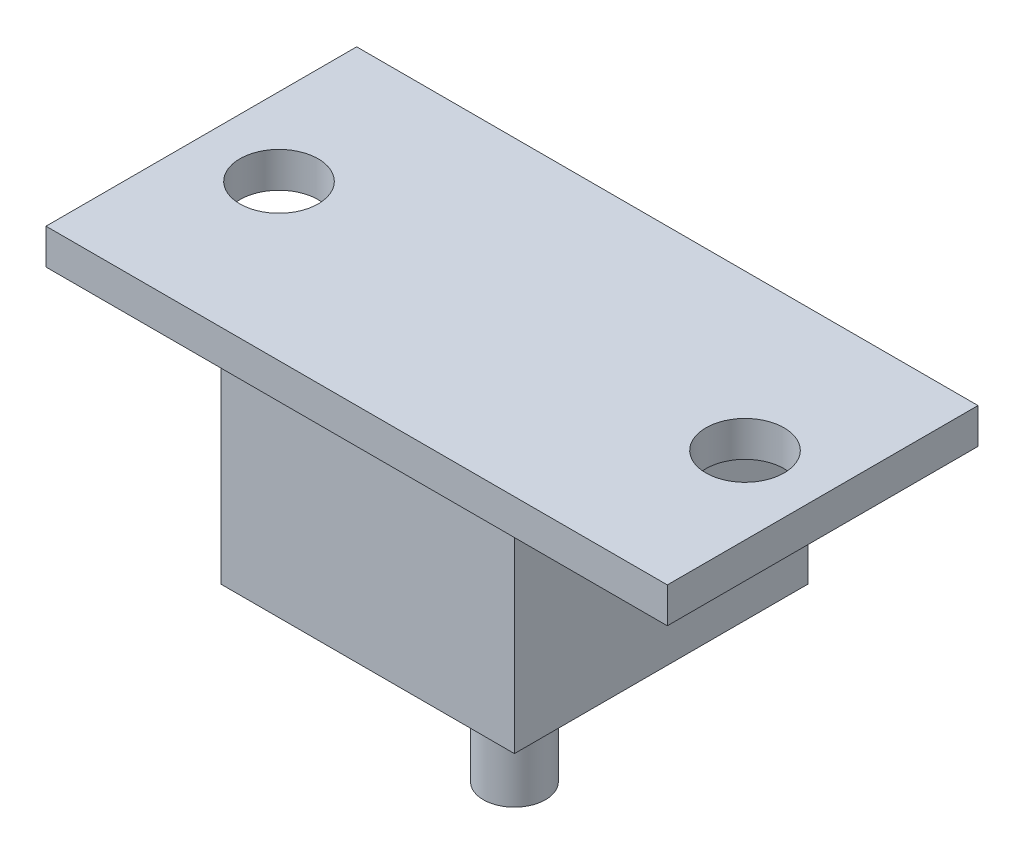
from build123d import *

# Parameters (mm, degrees)
SKETCH1_W            = 25.4
SKETCH1_H            = 12.7
BOSS_EXTRUDE1_DEPTH  = 1.4478
M3_CLEARANCE_HOLE3_D = 3.2
SKETCH5_W            = 12
SKETCH5_H            = 12
BOSS_EXTRUDE2_DEPTH  = 8
SKETCH6_R            = 1.27
BOSS_EXTRUDE3_DEPTH  = 7


with BuildPart() as part:
    # Sketch1 → Boss-Extrude1 (new body)
    with BuildSketch(Plane(origin=(0, 0, 0), x_dir=(1, 0, 0), z_dir=(0, 1, 0))):
        with Locations((12.7, 6.35)):
            Rectangle(SKETCH1_W, SKETCH1_H)
    extrude(amount=BOSS_EXTRUDE1_DEPTH)

    # M3 Clearance Hole3 (through all)
    with Locations(Plane(origin=(0, 1.4478, 0), x_dir=(1, 0, 0), z_dir=(0, 1, 0))):
        with Locations((3.175, 6.35), (22.225, 6.35)):
            Hole(M3_CLEARANCE_HOLE3_D / 2)

    # Sketch5 → Boss-Extrude2 (add)
    with BuildSketch(Plane.XZ):
        with Locations((12.799453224, -6.349268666)):
            Rectangle(SKETCH5_W, SKETCH5_H)
    extrude(amount=BOSS_EXTRUDE2_DEPTH)

    # Sketch6 → Boss-Extrude3 (add)
    with BuildSketch(Plane(origin=(0, -8, -15.542519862), x_dir=(-1, 0, 0), z_dir=(0, 1, 0))):
        with Locations(Location((-12.799453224, 9.193251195, 0), (0, 0, 90))):
            Circle(SKETCH6_R)
    extrude(amount=-BOSS_EXTRUDE3_DEPTH)


solid = part.part
